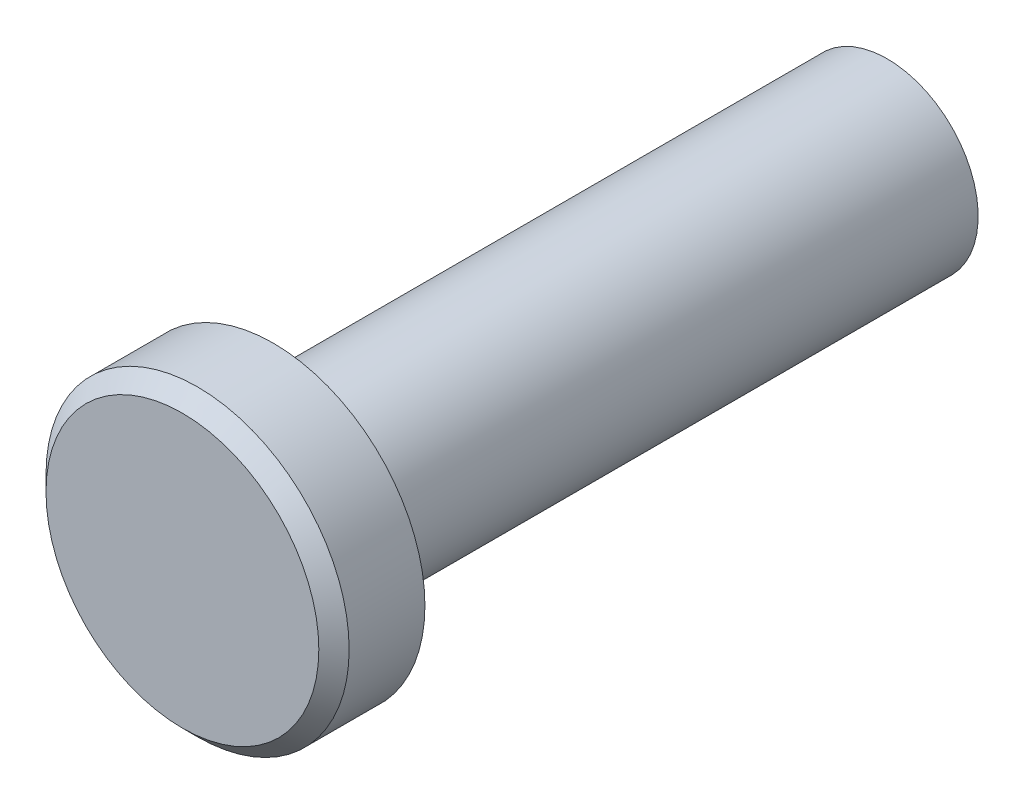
ISO-10303-21;
HEADER;
FILE_DESCRIPTION(('STEP AP214'),'2;1');
FILE_NAME('part.step','',(''),(''),'','','');
FILE_SCHEMA(('AUTOMOTIVE_DESIGN { 1 0 10303 214 1 1 1 1 }'));
ENDSEC;
DATA;
#1=APPLICATION_CONTEXT('core data for automotive mechanical design processes');
#2=APPLICATION_PROTOCOL_DEFINITION('international standard','automotive_design',2000,#1);
#3=PRODUCT_CONTEXT('',#1,'mechanical');
#4=PRODUCT('Part','Part','',(#3));
#5=PRODUCT_RELATED_PRODUCT_CATEGORY('part','',(#4));
#6=PRODUCT_DEFINITION_FORMATION('','',#4);
#7=PRODUCT_DEFINITION_CONTEXT('part definition',#1,'design');
#8=PRODUCT_DEFINITION('design','',#6,#7);
#9=PRODUCT_DEFINITION_SHAPE('','',#8);
#10=(LENGTH_UNIT() NAMED_UNIT(*) SI_UNIT(.MILLI.,.METRE.));
#11=(NAMED_UNIT(*) PLANE_ANGLE_UNIT() SI_UNIT($,.RADIAN.));
#12=(NAMED_UNIT(*) SI_UNIT($,.STERADIAN.) SOLID_ANGLE_UNIT());
#13=UNCERTAINTY_MEASURE_WITH_UNIT(LENGTH_MEASURE(1.E-05),#10,'distance_accuracy_value','');
#14=(GEOMETRIC_REPRESENTATION_CONTEXT(3) GLOBAL_UNCERTAINTY_ASSIGNED_CONTEXT((#13)) GLOBAL_UNIT_ASSIGNED_CONTEXT((#10,
#11,#12)) REPRESENTATION_CONTEXT('',''));
#15=CARTESIAN_POINT('',(0.,0.,0.));
#16=DIRECTION('',(0.,0.,1.));
#17=DIRECTION('',(1.,0.,0.));
#18=AXIS2_PLACEMENT_3D('',#15,#16,#17);
#19=CARTESIAN_POINT('',(0.,0.,3.));
#20=DIRECTION('',(0.,0.,-1.));
#21=DIRECTION('',(-1.,0.,0.));
#22=AXIS2_PLACEMENT_3D('',#19,#20,#21);
#23=CYLINDRICAL_SURFACE('',#22,5.);
#24=CARTESIAN_POINT('',(0.,0.,2.49999999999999));
#25=DIRECTION('',(0.,0.,1.));
#26=DIRECTION('',(1.,0.,0.));
#27=AXIS2_PLACEMENT_3D('',#24,#25,#26);
#28=CIRCLE('',#27,5.);
#29=CARTESIAN_POINT('',(5.,0.,2.49999999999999));
#30=VERTEX_POINT('',#29);
#31=EDGE_CURVE('E10',#30,#30,#28,.F.);
#32=ORIENTED_EDGE('',*,*,#31,.T.);
#33=EDGE_LOOP('',(#32));
#34=FACE_BOUND('',#33,.T.);
#35=CARTESIAN_POINT('',(0.,0.,0.));
#36=DIRECTION('',(0.,0.,1.));
#37=DIRECTION('',(1.,0.,0.));
#38=AXIS2_PLACEMENT_3D('',#35,#36,#37);
#39=CIRCLE('',#38,5.);
#40=CARTESIAN_POINT('',(5.,0.,0.));
#41=VERTEX_POINT('',#40);
#42=EDGE_CURVE('E46',#41,#41,#39,.T.);
#43=ORIENTED_EDGE('',*,*,#42,.T.);
#44=EDGE_LOOP('',(#43));
#45=FACE_BOUND('',#44,.T.);
#46=ADVANCED_FACE('F31',(#34,#45),#23,.T.);
#47=CARTESIAN_POINT('',(0.,0.,3.));
#48=DIRECTION('',(0.,0.,1.));
#49=DIRECTION('',(1.,0.,0.));
#50=AXIS2_PLACEMENT_3D('',#47,#48,#49);
#51=PLANE('',#50);
#52=CARTESIAN_POINT('',(0.,0.,3.));
#53=DIRECTION('',(0.,0.,1.));
#54=DIRECTION('',(1.,0.,0.));
#55=AXIS2_PLACEMENT_3D('',#52,#53,#54);
#56=CIRCLE('',#55,4.5);
#57=CARTESIAN_POINT('',(4.5,0.,3.));
#58=VERTEX_POINT('',#57);
#59=EDGE_CURVE('E38',#58,#58,#56,.T.);
#60=ORIENTED_EDGE('',*,*,#59,.T.);
#61=EDGE_LOOP('',(#60));
#62=FACE_BOUND('',#61,.T.);
#63=ADVANCED_FACE('F66',(#62),#51,.T.);
#64=CARTESIAN_POINT('',(0.,0.,0.));
#65=DIRECTION('',(0.,0.,1.));
#66=DIRECTION('',(1.,0.,0.));
#67=AXIS2_PLACEMENT_3D('',#64,#65,#66);
#68=PLANE('',#67);
#69=CARTESIAN_POINT('',(0.,0.,0.));
#70=DIRECTION('',(0.,0.,-1.));
#71=DIRECTION('',(-1.,0.,0.));
#72=AXIS2_PLACEMENT_3D('',#69,#70,#71);
#73=CIRCLE('',#72,3.);
#74=CARTESIAN_POINT('',(-3.,0.,0.));
#75=VERTEX_POINT('',#74);
#76=EDGE_CURVE('E42',#75,#75,#73,.T.);
#77=ORIENTED_EDGE('',*,*,#76,.F.);
#78=EDGE_LOOP('',(#77));
#79=FACE_BOUND('',#78,.T.);
#80=ORIENTED_EDGE('',*,*,#42,.F.);
#81=EDGE_LOOP('',(#80));
#82=FACE_BOUND('',#81,.T.);
#83=ADVANCED_FACE('F60',(#79,#82),#68,.F.);
#84=CARTESIAN_POINT('',(0.,0.,-20.25));
#85=DIRECTION('',(0.,0.,1.));
#86=DIRECTION('',(1.,0.,0.));
#87=AXIS2_PLACEMENT_3D('',#84,#85,#86);
#88=CYLINDRICAL_SURFACE('',#87,3.);
#89=CARTESIAN_POINT('',(0.,0.,-20.25));
#90=DIRECTION('',(0.,0.,-1.));
#91=DIRECTION('',(-1.,0.,0.));
#92=AXIS2_PLACEMENT_3D('',#89,#90,#91);
#93=CIRCLE('',#92,3.);
#94=CARTESIAN_POINT('',(-3.,0.,-20.25));
#95=VERTEX_POINT('',#94);
#96=EDGE_CURVE('E50',#95,#95,#93,.T.);
#97=ORIENTED_EDGE('',*,*,#96,.F.);
#98=EDGE_LOOP('',(#97));
#99=FACE_BOUND('',#98,.T.);
#100=ORIENTED_EDGE('',*,*,#76,.T.);
#101=EDGE_LOOP('',(#100));
#102=FACE_BOUND('',#101,.T.);
#103=ADVANCED_FACE('F57',(#99,#102),#88,.T.);
#104=CARTESIAN_POINT('',(0.,0.,-20.25));
#105=DIRECTION('',(0.,0.,-1.));
#106=DIRECTION('',(-1.,0.,0.));
#107=AXIS2_PLACEMENT_3D('',#104,#105,#106);
#108=PLANE('',#107);
#109=ORIENTED_EDGE('',*,*,#96,.T.);
#110=EDGE_LOOP('',(#109));
#111=FACE_BOUND('',#110,.T.);
#112=ADVANCED_FACE('F55',(#111),#108,.T.);
#113=CARTESIAN_POINT('',(0.,0.,3.));
#114=DIRECTION('',(0.,0.,-1.));
#115=DIRECTION('',(-1.,0.,0.));
#116=AXIS2_PLACEMENT_3D('',#113,#114,#115);
#117=CONICAL_SURFACE('',#116,4.5,0.785398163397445);
#118=ORIENTED_EDGE('',*,*,#31,.F.);
#119=EDGE_LOOP('',(#118));
#120=FACE_BOUND('',#119,.T.);
#121=ORIENTED_EDGE('',*,*,#59,.F.);
#122=EDGE_LOOP('',(#121));
#123=FACE_BOUND('',#122,.T.);
#124=ADVANCED_FACE('F33',(#120,#123),#117,.T.);
#125=CLOSED_SHELL('',(#46,#63,#83,#103,#112,#124));
#126=MANIFOLD_SOLID_BREP('B2',#125);
#127=ADVANCED_BREP_SHAPE_REPRESENTATION('',(#18,#126),#14);
#128=SHAPE_DEFINITION_REPRESENTATION(#9,#127);
ENDSEC;
END-ISO-10303-21;
